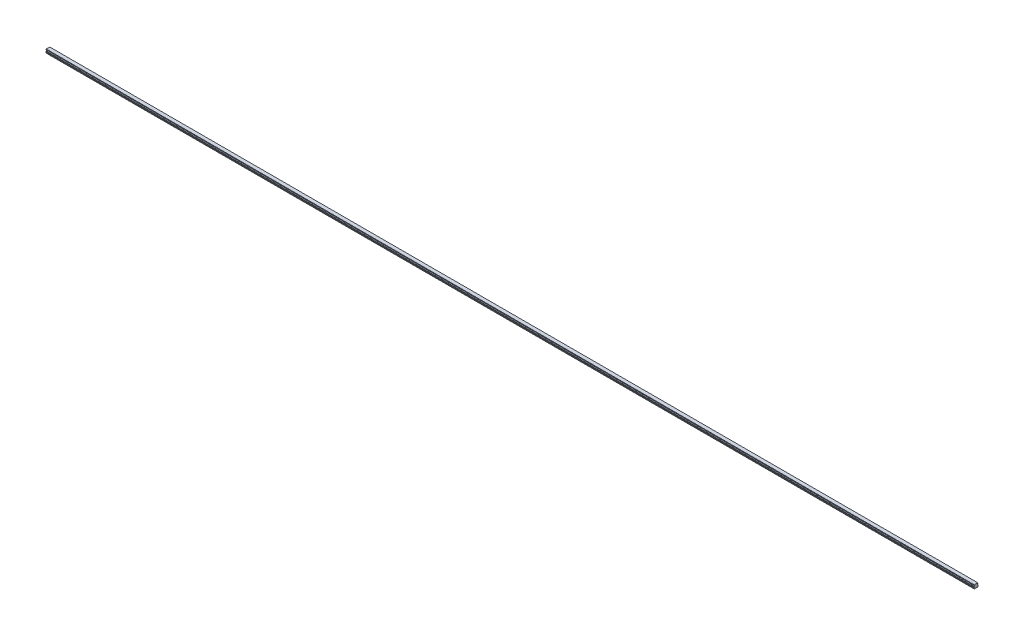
from build123d import *

# Parameters (mm, degrees)
BOSS_EXTRUDE1_DEPTH        = 3480
SKETCH3_R                  = 2.5
SKETCH3_R_2                = 2.1
CUT_EXTRUDE3_DEPTH         = 7
SKETCH3_2_R                = 2.1
CUT_EXTRUDE4_DEPTH         = 9.5
CHAMFER1_SIZE              = 0.4
LPATTERN2_COUNT            = 58
LPATTERN2_PITCH            = 60
CHAMFER1_OF_LPATTERN2_SIZE = 0.4


with BuildPart() as part:
    # Sketch1 → Boss-Extrude1 (new body)
    with BuildSketch(Plane(origin=(0, 0, 0), x_dir=(0, 0, -1), z_dir=(1, 0, 0))):
        with BuildLine():
            Line((6.59, 14), (-6.59, 14))
            Line((-6.59, 14), (-6.59, 13.15))
            Line((-6.59, 13.15), (-6.96, 12.356532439))
            Line((-6.96, 12.356532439), (-6.96, 11.435174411))
            ThreePointArc((-6.96, 11.435174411), (-5.25, 9.5), (-6.96, 7.564825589))
            Line((-6.96, 7.564825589), (-6.96, 6.643467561))
            Line((-6.96, 6.643467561), (-6.59, 5.85))
            Line((-6.59, 5.85), (-7.032116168, 4.2))
            Line((-7.032116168, 4.2), (-7.5, 3.929867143))
            Line((-7.5, 3.929867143), (-7.5, 1.4))
            Line((-7.5, 1.4), (-6.1, 0))
            Line((-6.1, 0), (-3.65, 0))
            Line((-3.65, 0), (-3.25, 0.4))
            Line((-3.25, 0.4), (3.25, 0.4))
            Line((3.25, 0.4), (3.65, 0))
            Line((3.65, 0), (6.1, 0))
            Line((6.1, 0), (7.5, 1.4))
            Line((7.5, 1.4), (7.5, 3.929867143))
            Line((7.5, 3.929867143), (7.032116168, 4.2))
            Line((7.032116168, 4.2), (6.59, 5.85))
            Line((6.59, 5.85), (6.96, 6.643467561))
            Line((6.96, 6.643467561), (6.96, 7.564825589))
            ThreePointArc((6.96, 7.564825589), (5.25, 9.5), (6.96, 11.435174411))
            Line((6.96, 11.435174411), (6.96, 12.356532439))
            Line((6.96, 12.356532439), (6.59, 13.15))
            Line((6.59, 13.15), (6.59, 14))
        make_face()
    extrude(amount=BOSS_EXTRUDE1_DEPTH)

    # Sketch3 → Cut-Extrude3 (cut)
    with BuildSketch(Plane.XZ):
        with Locations(Location((30, 0, 0), (0, 0, 270))):
            Circle(SKETCH3_R)
        with Locations(Location((30, 0, 0), (0, 0, 270))):
            Circle(SKETCH3_R_2, mode=Mode.SUBTRACT)
    cut_extrude3 = extrude(amount=-CUT_EXTRUDE3_DEPTH, mode=Mode.SUBTRACT)

    # Sketch3_2 → Cut-Extrude4 (cut)
    with BuildSketch(Plane.XZ):
        with Locations(Location((30, 0, 0), (0, 0, 270))):
            Circle(SKETCH3_2_R)
    cut_extrude4 = extrude(amount=-CUT_EXTRUDE4_DEPTH, mode=Mode.SUBTRACT)

    # Cut-Extrude5 cone 1 section (on through the dimple's axis) → Cut-Extrude5 (revolve, cut)
    with BuildSketch(Plane(origin=(30, 9.5, 0), x_dir=(0, 0, -1), z_dir=(1, 0, 0))):
        Polygon((0, 0), (2.1, 0), (0, 1.212435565), align=None)
    revolve(axis=Axis((30, 9.5, 0), (0, 1, 0)), mode=Mode.SUBTRACT)

    # Chamfer1
    chamfer1_edges = [part.edges().sort_by_distance(p)[0] for p in [
        (30, 0.4, 2.5),
    ]]
    chamfer(chamfer1_edges, length=CHAMFER1_SIZE)

    # LPattern2: Cut-Extrude3, Cut-Extrude4 ×58
    with Locations(*[(i * LPATTERN2_PITCH, 0, 0) for i in range(1, LPATTERN2_COUNT)]):
        add(cut_extrude3, mode=Mode.SUBTRACT)
        add(cut_extrude4, mode=Mode.SUBTRACT)

    # Chamfer1 of LPattern2
    chamfer1_of_lpattern2_edges = [part.edges().sort_by_distance(p)[0] for p in [
        (90, 0.4, 2.5),
        (150, 0.4, 2.5),
        (210, 0.4, 2.5),
        (270, 0.4, 2.5),
        (330, 0.4, 2.5),
        (390, 0.4, 2.5),
        (450, 0.4, 2.5),
        (510, 0.4, 2.5),
        (570, 0.4, 2.5),
        (630, 0.4, 2.5),
        (690, 0.4, 2.5),
        (750, 0.4, 2.5),
        (810, 0.4, 2.5),
        (870, 0.4, 2.5),
        (930, 0.4, 2.5),
        (990, 0.4, 2.5),
        (1050, 0.4, 2.5),
        (1110, 0.4, 2.5),
        (1170, 0.4, 2.5),
        (1230, 0.4, 2.5),
        (1290, 0.4, 2.5),
        (1350, 0.4, 2.5),
        (1410, 0.4, 2.5),
        (1470, 0.4, 2.5),
        (1530, 0.4, 2.5),
        (1590, 0.4, 2.5),
        (1650, 0.4, 2.5),
        (1710, 0.4, 2.5),
        (1770, 0.4, 2.5),
        (1830, 0.4, 2.5),
        (1890, 0.4, 2.5),
        (1950, 0.4, 2.5),
        (2010, 0.4, 2.5),
        (2070, 0.4, 2.5),
        (2130, 0.4, 2.5),
        (2190, 0.4, 2.5),
        (2250, 0.4, 2.5),
        (2310, 0.4, 2.5),
        (2370, 0.4, 2.5),
        (2430, 0.4, 2.5),
        (2490, 0.4, 2.5),
        (2550, 0.4, 2.5),
        (2610, 0.4, 2.5),
        (2670, 0.4, 2.5),
        (2730, 0.4, 2.5),
        (2790, 0.4, 2.5),
        (2850, 0.4, 2.5),
        (2910, 0.4, 2.5),
        (2970, 0.4, 2.5),
        (3030, 0.4, 2.5),
        (3090, 0.4, 2.5),
        (3150, 0.4, 2.5),
        (3210, 0.4, 2.5),
        (3270, 0.4, 2.5),
        (3330, 0.4, 2.5),
        (3390, 0.4, 2.5),
        (3450, 0.4, 2.5),
    ]]
    chamfer(chamfer1_of_lpattern2_edges, length=CHAMFER1_OF_LPATTERN2_SIZE)


solid = part.part
